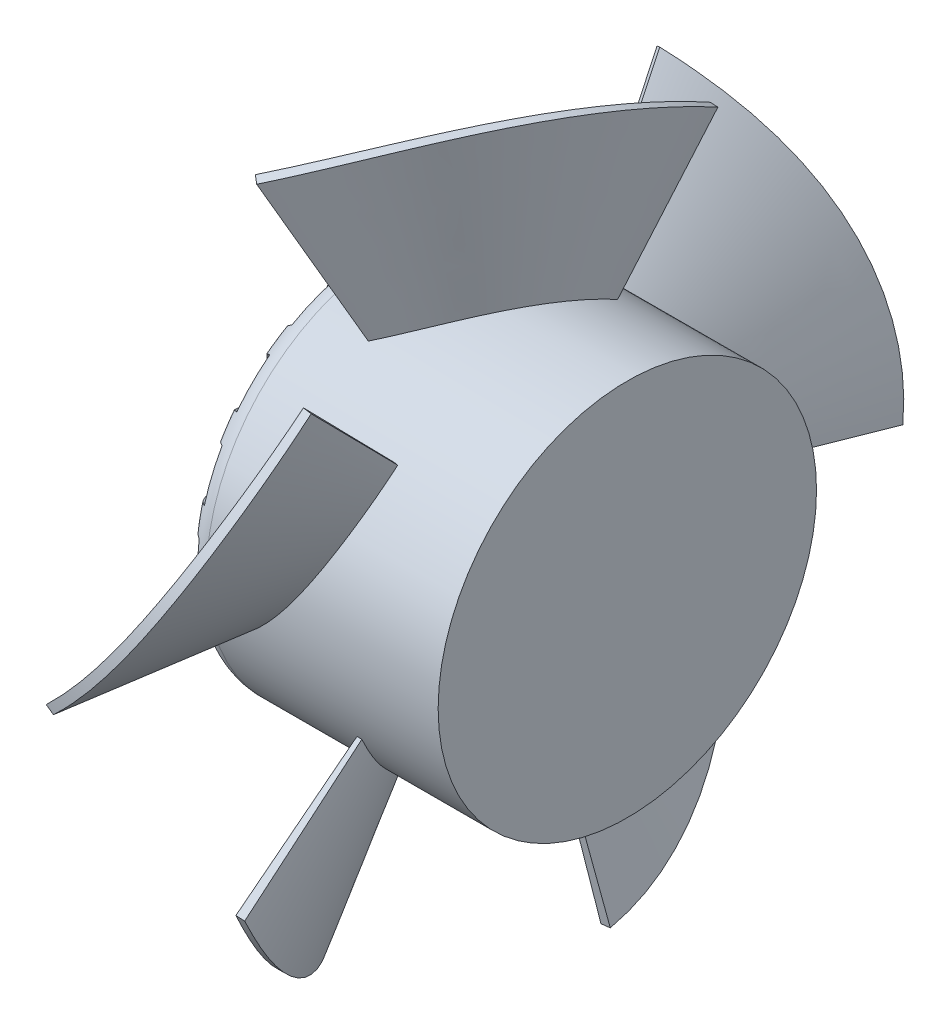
from build123d import *

# Parameters (mm, degrees)
SKETCH5_W                               = 27
SKETCH5_H                               = 20
CIRPATTERN1_COUNT                       = 5
SKETCH_CUT_BLADE_OUTSIDE_W              = 106.734
SKETCH_CUT_BLADE_OUTSIDE_H              = 103.461
SKETCH_CUT_BLADE_OUTSIDE_R              = 37
CUT_FAN_BLADE_DEPTH                     = 67.449694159
SKETCH6_R                               = 13.333333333
CUT_BODY_DEPTH                          = 1.25
COSMETIC_FILLET_R                       = 2.5
CUT_BODY_COSMETIC_BODY_DEPTH            = 1.25
CIRPATTERN_CUT_BODY_COSMETIC_BODY_COUNT = 16
SKETCH7_R                               = 6.666666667
SKETCH7_R_2                             = 3.333333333
EXTRUDE3_DEPTH                          = 1.666666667


with BuildPart() as part:
    # Sketch5 → Body (revolve)
    with BuildSketch(Plane.XY, mode=Mode.PRIVATE) as body_sk:
        with Locations((-18.5, 10)):
            Rectangle(SKETCH5_W, SKETCH5_H)
    revolve(body_sk.sketch.rotate(Axis((-32, 0, 0), (1, 0, 0)), 90), axis=Axis((-32, 0, 0), (1, 0, 0)))

    # Sketch-Blade-Top → Loft-Fan-Blade section 0
    with BuildSketch(Plane(origin=(0, 37, 0), x_dir=(-1, 0, 0), z_dir=(0, 1, 0)), mode=Mode.PRIVATE) as loft_fan_blade_s0:
        with BuildLine():
            Line((30.595675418, 16.051503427), (29.913677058, 16.782857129))
            ThreePointArc((29.913677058, 16.782857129), (17.608993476, 0.4539905), (11.631174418, -19.098574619))
            Line((11.631174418, -19.098574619), (12.623720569, -19.220443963))
            ThreePointArc((12.623720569, -19.220443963), (18.5, 0), (30.595675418, 16.051503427))
        make_face()
    loft_fan_blade = loft([loft_fan_blade_s0.sketch, Vertex(-18.5, 0, 0)])

    # CirPattern1: Loft-Fan-Blade ×5 about axis
    cirpattern1_axis = Axis((-32, 0, 0), (1, 0, 0))
    for i in range(1, CIRPATTERN1_COUNT):
        add(loft_fan_blade.rotate(cirpattern1_axis, i * 360 / CIRPATTERN1_COUNT))

    # Sketch-Cut-Blade outside → Cut-Fan-Blade (cut, through all)
    with BuildSketch(Plane(origin=(0, 0, 0), x_dir=(0, 0, -1), z_dir=(1, 0, 0))):
        with Locations((0.377, -2.1155)):
            Rectangle(SKETCH_CUT_BLADE_OUTSIDE_W, SKETCH_CUT_BLADE_OUTSIDE_H)
        Circle(SKETCH_CUT_BLADE_OUTSIDE_R, mode=Mode.SUBTRACT)
    extrude(amount=-CUT_FAN_BLADE_DEPTH, mode=Mode.SUBTRACT)

    # Sketch6 → Cut-Body (cut)
    with BuildSketch(Plane(origin=(-32, 0, 0), x_dir=(0, 0, -1), z_dir=(1, 0, 0))):
        Circle(SKETCH6_R)
    extrude(amount=CUT_BODY_DEPTH, mode=Mode.SUBTRACT)

    # Cosmetic-Fillet
    cosmetic_fillet_edges = [part.edges().sort_by_distance(p)[0] for p in [
        (-32, 0, -20),
    ]]
    fillet(cosmetic_fillet_edges, radius=COSMETIC_FILLET_R)

    # Sketch8 → Cut-Body-Cosmetic-Body (cut)
    with BuildSketch(Plane(origin=(-32, 0, 0), x_dir=(0, 0, -1), z_dir=(1, 0, 0))):
        with BuildLine():
            Line((2.455691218, 20), (2.455691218, 19.106201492))
            ThreePointArc((2.455691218, 19.106201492), (0, 16.650510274), (-2.455691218, 19.106201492))
            Line((-2.455691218, 19.106201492), (-2.455691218, 20))
            Line((-2.455691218, 20), (2.455691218, 20))
        make_face()
    cut_body_cosmetic_body = extrude(amount=CUT_BODY_COSMETIC_BODY_DEPTH, mode=Mode.SUBTRACT)

    # CirPattern-Cut-Body-Cosmetic-Body: Cut-Body-Cosmetic-Body ×16 about axis
    cirpattern_cut_body_cosmetic_body_axis = Axis((0, 0, 0), (1, 0, 0))
    for i in range(1, CIRPATTERN_CUT_BODY_COSMETIC_BODY_COUNT):
        add(cut_body_cosmetic_body.rotate(cirpattern_cut_body_cosmetic_body_axis, i * 360 / CIRPATTERN_CUT_BODY_COSMETIC_BODY_COUNT), mode=Mode.SUBTRACT)

    # Sketch7 → Extrude3 (cut)
    with BuildSketch(Plane(origin=(-32, 0, 0), x_dir=(0, 0, -1), z_dir=(1, 0, 0))):
        Circle(SKETCH7_R)
        Circle(SKETCH7_R_2, mode=Mode.SUBTRACT)
    extrude(amount=EXTRUDE3_DEPTH, mode=Mode.SUBTRACT)


solid = part.part
